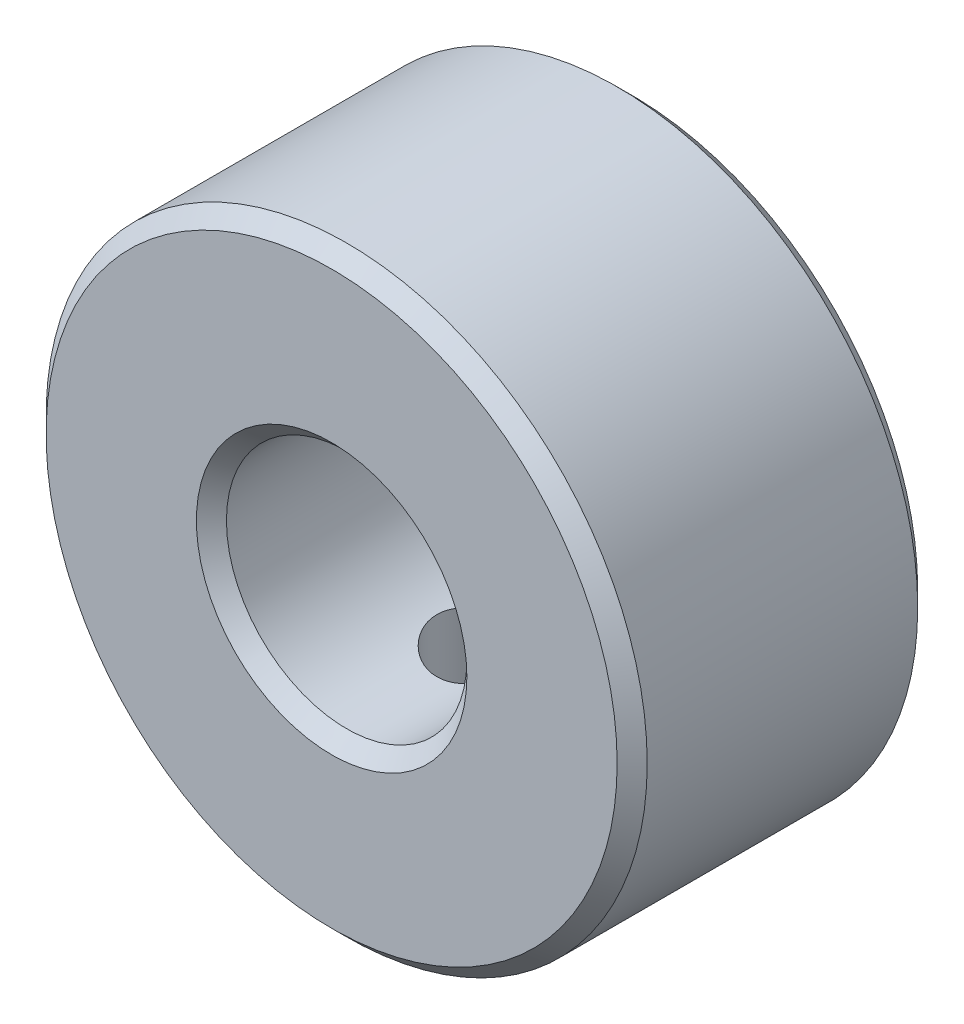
from build123d import *

# Parameters (mm, degrees)
SKETCH1_R          = 10
SKETCH1_R_2        = 4
BASE_EXTRUDE_DEPTH = 10
CHAMFER1_SIZE      = 0.5
SKETCH2_R          = 1.5
HOLE_DEPTH         = 18.320508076
CHAMFER2_SIZE      = 0.5


with BuildPart() as part:
    # Sketch1 → Base-Extrude (new body)
    with BuildSketch(Plane.XY):
        Circle(SKETCH1_R)
        Circle(SKETCH1_R_2, mode=Mode.SUBTRACT)
    extrude(amount=-BASE_EXTRUDE_DEPTH)

    # Chamfer1
    chamfer1_edges = [part.edges().sort_by_distance(p)[0] for p in [
        (-10, 0, 0),
        (-10, 0, -10),
    ]]
    chamfer(chamfer1_edges, length=CHAMFER1_SIZE)

    # Sketch2 → Hole (cut, through all)
    with BuildSketch(Plane(origin=(0, 0, 0), x_dir=(1, 0, 0), z_dir=(0, 1, 0))):
        with Locations(Location((0, 5, 0), (0, 0, 270))):
            Circle(SKETCH2_R)
    extrude(amount=-HOLE_DEPTH, mode=Mode.SUBTRACT)

    # Chamfer2
    chamfer2_edges = [part.edges().sort_by_distance(p)[0] for p in [
        (-4, 0, -10),
        (-4, 0, 0),
    ]]
    chamfer(chamfer2_edges, length=CHAMFER2_SIZE)


solid = part.part
